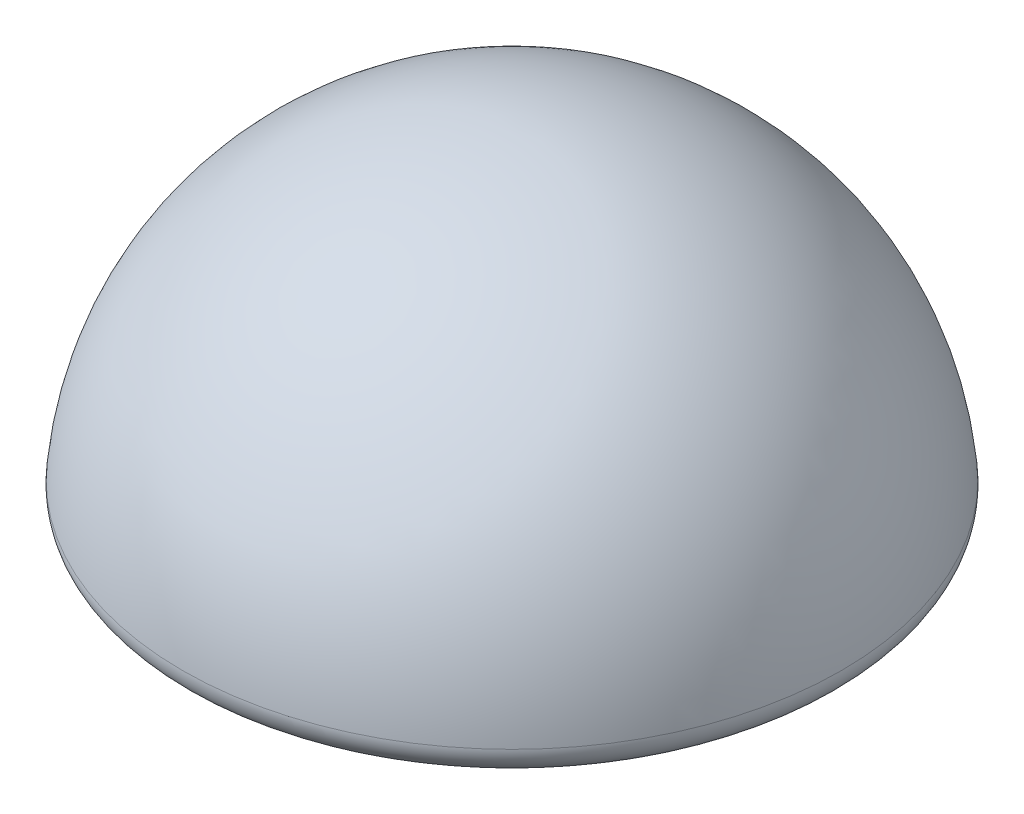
ISO-10303-21;
HEADER;
FILE_DESCRIPTION(('STEP AP214'),'2;1');
FILE_NAME('part.step','',(''),(''),'','','');
FILE_SCHEMA(('AUTOMOTIVE_DESIGN { 1 0 10303 214 1 1 1 1 }'));
ENDSEC;
DATA;
#1=APPLICATION_CONTEXT('core data for automotive mechanical design processes');
#2=APPLICATION_PROTOCOL_DEFINITION('international standard','automotive_design',2000,#1);
#3=PRODUCT_CONTEXT('',#1,'mechanical');
#4=PRODUCT('Part','Part','',(#3));
#5=PRODUCT_RELATED_PRODUCT_CATEGORY('part','',(#4));
#6=PRODUCT_DEFINITION_FORMATION('','',#4);
#7=PRODUCT_DEFINITION_CONTEXT('part definition',#1,'design');
#8=PRODUCT_DEFINITION('design','',#6,#7);
#9=PRODUCT_DEFINITION_SHAPE('','',#8);
#10=(LENGTH_UNIT() NAMED_UNIT(*) SI_UNIT(.MILLI.,.METRE.));
#11=(NAMED_UNIT(*) PLANE_ANGLE_UNIT() SI_UNIT($,.RADIAN.));
#12=(NAMED_UNIT(*) SI_UNIT($,.STERADIAN.) SOLID_ANGLE_UNIT());
#13=UNCERTAINTY_MEASURE_WITH_UNIT(LENGTH_MEASURE(1.E-05),#10,'distance_accuracy_value','');
#14=(GEOMETRIC_REPRESENTATION_CONTEXT(3) GLOBAL_UNCERTAINTY_ASSIGNED_CONTEXT((#13)) GLOBAL_UNIT_ASSIGNED_CONTEXT((#10,
#11,#12)) REPRESENTATION_CONTEXT('',''));
#15=CARTESIAN_POINT('',(0.,0.,0.));
#16=DIRECTION('',(0.,0.,1.));
#17=DIRECTION('',(1.,0.,0.));
#18=AXIS2_PLACEMENT_3D('',#15,#16,#17);
#19=CARTESIAN_POINT('',(0.,0.,0.));
#20=DIRECTION('',(0.,-1.,0.));
#21=DIRECTION('',(0.,0.,-1.));
#22=AXIS2_PLACEMENT_3D('',#19,#20,#21);
#23=PLANE('',#22);
#24=CARTESIAN_POINT('',(0.,0.,0.));
#25=DIRECTION('',(0.,-1.,0.));
#26=DIRECTION('',(0.,0.,-1.));
#27=AXIS2_PLACEMENT_3D('',#24,#25,#26);
#28=CIRCLE('',#27,22.9128784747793);
#29=CARTESIAN_POINT('',(0.,0.,-22.9128784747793));
#30=VERTEX_POINT('',#29);
#31=EDGE_CURVE('E38',#30,#30,#28,.T.);
#32=ORIENTED_EDGE('',*,*,#31,.T.);
#33=EDGE_LOOP('',(#32));
#34=FACE_BOUND('',#33,.T.);
#35=CARTESIAN_POINT('',(0.,0.,0.));
#36=DIRECTION('',(0.,-1.,0.));
#37=DIRECTION('',(0.,0.,-1.));
#38=AXIS2_PLACEMENT_3D('',#35,#36,#37);
#39=CIRCLE('',#38,12.25);
#40=CARTESIAN_POINT('',(0.,0.,-12.25));
#41=VERTEX_POINT('',#40);
#42=EDGE_CURVE('E46',#41,#41,#39,.T.);
#43=ORIENTED_EDGE('',*,*,#42,.F.);
#44=EDGE_LOOP('',(#43));
#45=FACE_BOUND('',#44,.T.);
#46=ADVANCED_FACE('F31',(#34,#45),#23,.T.);
#47=CARTESIAN_POINT('',(0.,0.,0.));
#48=DIRECTION('',(0.,-1.,0.));
#49=DIRECTION('',(1.,0.,0.));
#50=AXIS2_PLACEMENT_3D('',#47,#48,#49);
#51=SPHERICAL_SURFACE('',#50,25.0000000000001);
#52=CARTESIAN_POINT('',(0.,2.17391304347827,0.));
#53=DIRECTION('',(0.,-1.,0.));
#54=DIRECTION('',(0.,0.,-1.));
#55=AXIS2_PLACEMENT_3D('',#52,#53,#54);
#56=CIRCLE('',#55,24.9053026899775);
#57=CARTESIAN_POINT('',(0.,2.17391304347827,-24.9053026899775));
#58=VERTEX_POINT('',#57);
#59=EDGE_CURVE('E10',#58,#58,#56,.F.);
#60=ORIENTED_EDGE('',*,*,#59,.T.);
#61=EDGE_LOOP('',(#60));
#62=FACE_BOUND('',#61,.T.);
#63=ADVANCED_FACE('F55',(#62),#51,.T.);
#64=CARTESIAN_POINT('',(0.,16.,0.));
#65=DIRECTION('',(0.,-1.,0.));
#66=DIRECTION('',(0.,0.,-1.));
#67=AXIS2_PLACEMENT_3D('',#64,#65,#66);
#68=CYLINDRICAL_SURFACE('',#67,12.25);
#69=CARTESIAN_POINT('',(0.,16.,0.));
#70=DIRECTION('',(0.,-1.,0.));
#71=DIRECTION('',(0.,0.,-1.));
#72=AXIS2_PLACEMENT_3D('',#69,#70,#71);
#73=CIRCLE('',#72,12.25);
#74=CARTESIAN_POINT('',(0.,16.,-12.25));
#75=VERTEX_POINT('',#74);
#76=EDGE_CURVE('E42',#75,#75,#73,.T.);
#77=ORIENTED_EDGE('',*,*,#76,.F.);
#78=EDGE_LOOP('',(#77));
#79=FACE_BOUND('',#78,.T.);
#80=ORIENTED_EDGE('',*,*,#42,.T.);
#81=EDGE_LOOP('',(#80));
#82=FACE_BOUND('',#81,.T.);
#83=ADVANCED_FACE('F52',(#79,#82),#68,.F.);
#84=CARTESIAN_POINT('',(0.,16.,0.));
#85=DIRECTION('',(0.,-1.,0.));
#86=DIRECTION('',(0.,0.,-1.));
#87=AXIS2_PLACEMENT_3D('',#84,#85,#86);
#88=PLANE('',#87);
#89=ORIENTED_EDGE('',*,*,#76,.T.);
#90=EDGE_LOOP('',(#89));
#91=FACE_BOUND('',#90,.T.);
#92=ADVANCED_FACE('F64',(#91),#88,.T.);
#93=CARTESIAN_POINT('',(0.,2.,0.));
#94=DIRECTION('',(0.,-1.,0.));
#95=DIRECTION('',(0.,0.,-1.));
#96=AXIS2_PLACEMENT_3D('',#93,#94,#95);
#97=TOROIDAL_SURFACE('',#96,22.9128784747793,2.);
#98=ORIENTED_EDGE('',*,*,#59,.F.);
#99=EDGE_LOOP('',(#98));
#100=FACE_BOUND('',#99,.T.);
#101=ORIENTED_EDGE('',*,*,#31,.F.);
#102=EDGE_LOOP('',(#101));
#103=FACE_BOUND('',#102,.T.);
#104=ADVANCED_FACE('F33',(#100,#103),#97,.T.);
#105=CLOSED_SHELL('',(#46,#63,#83,#92,#104));
#106=MANIFOLD_SOLID_BREP('B2',#105);
#107=ADVANCED_BREP_SHAPE_REPRESENTATION('',(#18,#106),#14);
#108=SHAPE_DEFINITION_REPRESENTATION(#9,#107);
ENDSEC;
END-ISO-10303-21;
